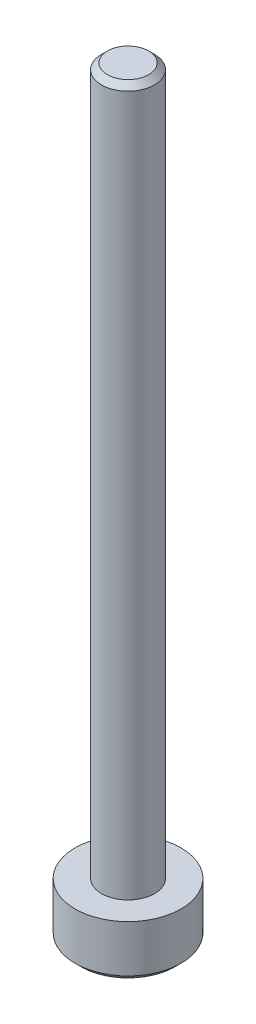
ISO-10303-21;
HEADER;
FILE_DESCRIPTION(('STEP AP214'),'2;1');
FILE_NAME('part.step','',(''),(''),'','','');
FILE_SCHEMA(('AUTOMOTIVE_DESIGN { 1 0 10303 214 1 1 1 1 }'));
ENDSEC;
DATA;
#1=APPLICATION_CONTEXT('core data for automotive mechanical design processes');
#2=APPLICATION_PROTOCOL_DEFINITION('international standard','automotive_design',2000,#1);
#3=PRODUCT_CONTEXT('',#1,'mechanical');
#4=PRODUCT('Part','Part','',(#3));
#5=PRODUCT_RELATED_PRODUCT_CATEGORY('part','',(#4));
#6=PRODUCT_DEFINITION_FORMATION('','',#4);
#7=PRODUCT_DEFINITION_CONTEXT('part definition',#1,'design');
#8=PRODUCT_DEFINITION('design','',#6,#7);
#9=PRODUCT_DEFINITION_SHAPE('','',#8);
#10=(LENGTH_UNIT() NAMED_UNIT(*) SI_UNIT(.MILLI.,.METRE.));
#11=(NAMED_UNIT(*) PLANE_ANGLE_UNIT() SI_UNIT($,.RADIAN.));
#12=(NAMED_UNIT(*) SI_UNIT($,.STERADIAN.) SOLID_ANGLE_UNIT());
#13=UNCERTAINTY_MEASURE_WITH_UNIT(LENGTH_MEASURE(1.E-05),#10,'distance_accuracy_value','');
#14=(GEOMETRIC_REPRESENTATION_CONTEXT(3) GLOBAL_UNCERTAINTY_ASSIGNED_CONTEXT((#13)) GLOBAL_UNIT_ASSIGNED_CONTEXT((#10,
#11,#12)) REPRESENTATION_CONTEXT('',''));
#15=CARTESIAN_POINT('',(0.,0.,0.));
#16=DIRECTION('',(0.,0.,1.));
#17=DIRECTION('',(1.,0.,0.));
#18=AXIS2_PLACEMENT_3D('',#15,#16,#17);
#19=CARTESIAN_POINT('',(0.,40.,0.));
#20=DIRECTION('',(0.,-1.,0.));
#21=DIRECTION('',(0.,0.,-1.));
#22=AXIS2_PLACEMENT_3D('',#19,#20,#21);
#23=CYLINDRICAL_SURFACE('',#22,1.5);
#24=CARTESIAN_POINT('',(0.,39.6666666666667,0.));
#25=DIRECTION('',(0.,1.,0.));
#26=DIRECTION('',(0.,0.,1.));
#27=AXIS2_PLACEMENT_3D('',#24,#25,#26);
#28=CIRCLE('',#27,1.5);
#29=CARTESIAN_POINT('',(0.,39.6666666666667,1.5));
#30=VERTEX_POINT('',#29);
#31=EDGE_CURVE('E182',#30,#30,#28,.F.);
#32=ORIENTED_EDGE('',*,*,#31,.T.);
#33=EDGE_LOOP('',(#32));
#34=FACE_BOUND('',#33,.T.);
#35=CARTESIAN_POINT('',(0.,0.,0.));
#36=DIRECTION('',(0.,1.,0.));
#37=DIRECTION('',(0.,0.,1.));
#38=AXIS2_PLACEMENT_3D('',#35,#36,#37);
#39=CIRCLE('',#38,1.5);
#40=CARTESIAN_POINT('',(0.,0.,1.5));
#41=VERTEX_POINT('',#40);
#42=EDGE_CURVE('E174',#41,#41,#39,.T.);
#43=ORIENTED_EDGE('',*,*,#42,.T.);
#44=EDGE_LOOP('',(#43));
#45=FACE_BOUND('',#44,.T.);
#46=ADVANCED_FACE('F45',(#34,#45),#23,.T.);
#47=CARTESIAN_POINT('',(0.,40.,0.));
#48=DIRECTION('',(0.,1.,0.));
#49=DIRECTION('',(0.,0.,1.));
#50=AXIS2_PLACEMENT_3D('',#47,#48,#49);
#51=PLANE('',#50);
#52=CARTESIAN_POINT('',(0.,40.,0.));
#53=DIRECTION('',(0.,1.,0.));
#54=DIRECTION('',(0.,0.,1.));
#55=AXIS2_PLACEMENT_3D('',#52,#53,#54);
#56=CIRCLE('',#55,1.16666666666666);
#57=CARTESIAN_POINT('',(0.,40.,1.16666666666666));
#58=VERTEX_POINT('',#57);
#59=EDGE_CURVE('E178',#58,#58,#56,.T.);
#60=ORIENTED_EDGE('',*,*,#59,.T.);
#61=EDGE_LOOP('',(#60));
#62=FACE_BOUND('',#61,.T.);
#63=ADVANCED_FACE('F201',(#62),#51,.T.);
#64=CARTESIAN_POINT('',(0.,-3.,0.));
#65=DIRECTION('',(0.,1.,0.));
#66=DIRECTION('',(0.,0.,1.));
#67=AXIS2_PLACEMENT_3D('',#64,#65,#66);
#68=CYLINDRICAL_SURFACE('',#67,3.);
#69=CARTESIAN_POINT('',(0.,-2.66666666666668,0.));
#70=DIRECTION('',(0.,-1.,0.));
#71=DIRECTION('',(0.,0.,-1.));
#72=AXIS2_PLACEMENT_3D('',#69,#70,#71);
#73=CIRCLE('',#72,3.);
#74=CARTESIAN_POINT('',(0.,-2.66666666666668,-3.));
#75=VERTEX_POINT('',#74);
#76=EDGE_CURVE('E11',#75,#75,#73,.F.);
#77=ORIENTED_EDGE('',*,*,#76,.T.);
#78=EDGE_LOOP('',(#77));
#79=FACE_BOUND('',#78,.T.);
#80=CARTESIAN_POINT('',(0.,0.,0.));
#81=DIRECTION('',(0.,-1.,0.));
#82=DIRECTION('',(0.,0.,-1.));
#83=AXIS2_PLACEMENT_3D('',#80,#81,#82);
#84=CIRCLE('',#83,3.);
#85=CARTESIAN_POINT('',(0.,0.,-3.));
#86=VERTEX_POINT('',#85);
#87=EDGE_CURVE('E161',#86,#86,#84,.T.);
#88=ORIENTED_EDGE('',*,*,#87,.T.);
#89=EDGE_LOOP('',(#88));
#90=FACE_BOUND('',#89,.T.);
#91=ADVANCED_FACE('F207',(#79,#90),#68,.T.);
#92=CARTESIAN_POINT('',(0.,-3.,0.));
#93=DIRECTION('',(0.,-1.,0.));
#94=DIRECTION('',(0.,0.,-1.));
#95=AXIS2_PLACEMENT_3D('',#92,#93,#94);
#96=PLANE('',#95);
#97=CARTESIAN_POINT('',(0.,-3.,0.));
#98=DIRECTION('',(0.,-1.,0.));
#99=DIRECTION('',(0.,0.,-1.));
#100=AXIS2_PLACEMENT_3D('',#97,#98,#99);
#101=CIRCLE('',#100,2.66666666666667);
#102=CARTESIAN_POINT('',(0.,-3.,-2.66666666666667));
#103=VERTEX_POINT('',#102);
#104=EDGE_CURVE('E55',#103,#103,#101,.T.);
#105=ORIENTED_EDGE('',*,*,#104,.T.);
#106=EDGE_LOOP('',(#105));
#107=FACE_BOUND('',#106,.T.);
#108=DIRECTION('',(-0.866025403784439,0.,0.5));
#109=VECTOR('',#108,1.);
#110=CARTESIAN_POINT('',(1.5,-3.,0.86602540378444));
#111=LINE('',#110,#109);
#112=CARTESIAN_POINT('',(1.5,-3.,0.86602540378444));
#113=VERTEX_POINT('',#112);
#114=CARTESIAN_POINT('',(0.,-3.,1.73205080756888));
#115=VERTEX_POINT('',#114);
#116=EDGE_CURVE('E62',#113,#115,#111,.T.);
#117=ORIENTED_EDGE('',*,*,#116,.F.);
#118=DIRECTION('',(0.,0.,1.));
#119=VECTOR('',#118,1.);
#120=CARTESIAN_POINT('',(1.5,-3.,-0.866025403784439));
#121=LINE('',#120,#119);
#122=CARTESIAN_POINT('',(1.5,-3.,-0.866025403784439));
#123=VERTEX_POINT('',#122);
#124=EDGE_CURVE('E155',#123,#113,#121,.T.);
#125=ORIENTED_EDGE('',*,*,#124,.F.);
#126=DIRECTION('',(0.866025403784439,0.,0.5));
#127=VECTOR('',#126,1.);
#128=CARTESIAN_POINT('',(0.,-3.,-1.73205080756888));
#129=LINE('',#128,#127);
#130=CARTESIAN_POINT('',(0.,-3.,-1.73205080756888));
#131=VERTEX_POINT('',#130);
#132=EDGE_CURVE('E152',#131,#123,#129,.T.);
#133=ORIENTED_EDGE('',*,*,#132,.F.);
#134=DIRECTION('',(0.866025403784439,0.,-0.5));
#135=VECTOR('',#134,1.);
#136=CARTESIAN_POINT('',(-1.5,-3.,-0.866025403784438));
#137=LINE('',#136,#135);
#138=CARTESIAN_POINT('',(-1.5,-3.,-0.866025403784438));
#139=VERTEX_POINT('',#138);
#140=EDGE_CURVE('E110',#139,#131,#137,.T.);
#141=ORIENTED_EDGE('',*,*,#140,.F.);
#142=DIRECTION('',(0.,0.,-1.));
#143=VECTOR('',#142,1.);
#144=CARTESIAN_POINT('',(-1.5,-3.,0.86602540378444));
#145=LINE('',#144,#143);
#146=CARTESIAN_POINT('',(-1.5,-3.,0.86602540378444));
#147=VERTEX_POINT('',#146);
#148=EDGE_CURVE('E146',#147,#139,#145,.T.);
#149=ORIENTED_EDGE('',*,*,#148,.F.);
#150=DIRECTION('',(-0.866025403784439,0.,-0.5));
#151=VECTOR('',#150,1.);
#152=CARTESIAN_POINT('',(0.,-3.,1.73205080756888));
#153=LINE('',#152,#151);
#154=EDGE_CURVE('E142',#115,#147,#153,.T.);
#155=ORIENTED_EDGE('',*,*,#154,.F.);
#156=EDGE_LOOP('',(#117,#125,#133,#141,#149,#155));
#157=FACE_BOUND('',#156,.T.);
#158=ADVANCED_FACE('F189',(#107,#157),#96,.T.);
#159=CARTESIAN_POINT('',(0.,0.,0.));
#160=DIRECTION('',(0.,-1.,0.));
#161=DIRECTION('',(0.,0.,-1.));
#162=AXIS2_PLACEMENT_3D('',#159,#160,#161);
#163=PLANE('',#162);
#164=ORIENTED_EDGE('',*,*,#42,.F.);
#165=EDGE_LOOP('',(#164));
#166=FACE_BOUND('',#165,.T.);
#167=ORIENTED_EDGE('',*,*,#87,.F.);
#168=EDGE_LOOP('',(#167));
#169=FACE_BOUND('',#168,.T.);
#170=ADVANCED_FACE('F220',(#166,#169),#163,.F.);
#171=CARTESIAN_POINT('',(1.5,-1.,0.86602540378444));
#172=DIRECTION('',(0.5,0.,0.866025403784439));
#173=DIRECTION('',(0.866025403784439,0.,-0.5));
#174=AXIS2_PLACEMENT_3D('',#171,#172,#173);
#175=PLANE('',#174);
#176=ORIENTED_EDGE('',*,*,#116,.T.);
#177=DIRECTION('',(0.,-1.,0.));
#178=VECTOR('',#177,1.);
#179=CARTESIAN_POINT('',(0.,-1.,1.73205080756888));
#180=LINE('',#179,#178);
#181=CARTESIAN_POINT('',(0.,-1.,1.73205080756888));
#182=VERTEX_POINT('',#181);
#183=EDGE_CURVE('E92',#182,#115,#180,.T.);
#184=ORIENTED_EDGE('',*,*,#183,.F.);
#185=DIRECTION('',(-0.866025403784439,0.,0.5));
#186=VECTOR('',#185,1.);
#187=CARTESIAN_POINT('',(1.5,-1.,0.86602540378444));
#188=LINE('',#187,#186);
#189=CARTESIAN_POINT('',(1.5,-1.,0.86602540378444));
#190=VERTEX_POINT('',#189);
#191=EDGE_CURVE('E158',#190,#182,#188,.T.);
#192=ORIENTED_EDGE('',*,*,#191,.F.);
#193=DIRECTION('',(0.,-1.,0.));
#194=VECTOR('',#193,1.);
#195=CARTESIAN_POINT('',(1.5,-1.,0.86602540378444));
#196=LINE('',#195,#194);
#197=EDGE_CURVE('E70',#190,#113,#196,.T.);
#198=ORIENTED_EDGE('',*,*,#197,.T.);
#199=EDGE_LOOP('',(#176,#184,#192,#198));
#200=FACE_BOUND('',#199,.T.);
#201=ADVANCED_FACE('F223',(#200),#175,.F.);
#202=CARTESIAN_POINT('',(1.5,-1.,-0.866025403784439));
#203=DIRECTION('',(1.,0.,0.));
#204=DIRECTION('',(0.,0.,-1.));
#205=AXIS2_PLACEMENT_3D('',#202,#203,#204);
#206=PLANE('',#205);
#207=ORIENTED_EDGE('',*,*,#124,.T.);
#208=ORIENTED_EDGE('',*,*,#197,.F.);
#209=DIRECTION('',(0.,0.,1.));
#210=VECTOR('',#209,1.);
#211=CARTESIAN_POINT('',(1.5,-1.,-0.866025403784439));
#212=LINE('',#211,#210);
#213=CARTESIAN_POINT('',(1.5,-1.,-0.866025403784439));
#214=VERTEX_POINT('',#213);
#215=EDGE_CURVE('E124',#214,#190,#212,.T.);
#216=ORIENTED_EDGE('',*,*,#215,.F.);
#217=DIRECTION('',(0.,-1.,0.));
#218=VECTOR('',#217,1.);
#219=CARTESIAN_POINT('',(1.5,-1.,-0.866025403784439));
#220=LINE('',#219,#218);
#221=EDGE_CURVE('E115',#214,#123,#220,.T.);
#222=ORIENTED_EDGE('',*,*,#221,.T.);
#223=EDGE_LOOP('',(#207,#208,#216,#222));
#224=FACE_BOUND('',#223,.T.);
#225=ADVANCED_FACE('F229',(#224),#206,.F.);
#226=CARTESIAN_POINT('',(0.,-1.,-1.73205080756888));
#227=DIRECTION('',(0.5,0.,-0.866025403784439));
#228=DIRECTION('',(-0.866025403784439,0.,-0.5));
#229=AXIS2_PLACEMENT_3D('',#226,#227,#228);
#230=PLANE('',#229);
#231=ORIENTED_EDGE('',*,*,#132,.T.);
#232=ORIENTED_EDGE('',*,*,#221,.F.);
#233=DIRECTION('',(0.866025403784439,0.,0.5));
#234=VECTOR('',#233,1.);
#235=CARTESIAN_POINT('',(0.,-1.,-1.73205080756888));
#236=LINE('',#235,#234);
#237=CARTESIAN_POINT('',(0.,-1.,-1.73205080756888));
#238=VERTEX_POINT('',#237);
#239=EDGE_CURVE('E119',#238,#214,#236,.T.);
#240=ORIENTED_EDGE('',*,*,#239,.F.);
#241=DIRECTION('',(0.,-1.,0.));
#242=VECTOR('',#241,1.);
#243=CARTESIAN_POINT('',(0.,-1.,-1.73205080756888));
#244=LINE('',#243,#242);
#245=EDGE_CURVE('E103',#238,#131,#244,.T.);
#246=ORIENTED_EDGE('',*,*,#245,.T.);
#247=EDGE_LOOP('',(#231,#232,#240,#246));
#248=FACE_BOUND('',#247,.T.);
#249=ADVANCED_FACE('F120',(#248),#230,.F.);
#250=CARTESIAN_POINT('',(-1.5,-1.,-0.866025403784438));
#251=DIRECTION('',(-0.5,0.,-0.866025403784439));
#252=DIRECTION('',(-0.866025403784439,0.,0.5));
#253=AXIS2_PLACEMENT_3D('',#250,#251,#252);
#254=PLANE('',#253);
#255=ORIENTED_EDGE('',*,*,#140,.T.);
#256=ORIENTED_EDGE('',*,*,#245,.F.);
#257=DIRECTION('',(0.866025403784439,0.,-0.5));
#258=VECTOR('',#257,1.);
#259=CARTESIAN_POINT('',(-1.5,-1.,-0.866025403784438));
#260=LINE('',#259,#258);
#261=CARTESIAN_POINT('',(-1.5,-1.,-0.866025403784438));
#262=VERTEX_POINT('',#261);
#263=EDGE_CURVE('E107',#262,#238,#260,.T.);
#264=ORIENTED_EDGE('',*,*,#263,.F.);
#265=DIRECTION('',(0.,-1.,0.));
#266=VECTOR('',#265,1.);
#267=CARTESIAN_POINT('',(-1.5,-1.,-0.866025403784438));
#268=LINE('',#267,#266);
#269=EDGE_CURVE('E116',#262,#139,#268,.T.);
#270=ORIENTED_EDGE('',*,*,#269,.T.);
#271=EDGE_LOOP('',(#255,#256,#264,#270));
#272=FACE_BOUND('',#271,.T.);
#273=ADVANCED_FACE('F105',(#272),#254,.F.);
#274=CARTESIAN_POINT('',(-1.5,-1.,0.86602540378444));
#275=DIRECTION('',(-1.,0.,0.));
#276=DIRECTION('',(0.,0.,1.));
#277=AXIS2_PLACEMENT_3D('',#274,#275,#276);
#278=PLANE('',#277);
#279=ORIENTED_EDGE('',*,*,#148,.T.);
#280=ORIENTED_EDGE('',*,*,#269,.F.);
#281=DIRECTION('',(0.,0.,-1.));
#282=VECTOR('',#281,1.);
#283=CARTESIAN_POINT('',(-1.5,-1.,0.86602540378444));
#284=LINE('',#283,#282);
#285=CARTESIAN_POINT('',(-1.5,-1.,0.86602540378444));
#286=VERTEX_POINT('',#285);
#287=EDGE_CURVE('E130',#286,#262,#284,.T.);
#288=ORIENTED_EDGE('',*,*,#287,.F.);
#289=DIRECTION('',(0.,-1.,0.));
#290=VECTOR('',#289,1.);
#291=CARTESIAN_POINT('',(-1.5,-1.,0.86602540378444));
#292=LINE('',#291,#290);
#293=EDGE_CURVE('E166',#286,#147,#292,.T.);
#294=ORIENTED_EDGE('',*,*,#293,.T.);
#295=EDGE_LOOP('',(#279,#280,#288,#294));
#296=FACE_BOUND('',#295,.T.);
#297=ADVANCED_FACE('F233',(#296),#278,.F.);
#298=CARTESIAN_POINT('',(0.,-1.,1.73205080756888));
#299=DIRECTION('',(-0.5,0.,0.866025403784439));
#300=DIRECTION('',(0.866025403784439,0.,0.5));
#301=AXIS2_PLACEMENT_3D('',#298,#299,#300);
#302=PLANE('',#301);
#303=ORIENTED_EDGE('',*,*,#154,.T.);
#304=ORIENTED_EDGE('',*,*,#293,.F.);
#305=DIRECTION('',(-0.866025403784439,0.,-0.5));
#306=VECTOR('',#305,1.);
#307=CARTESIAN_POINT('',(0.,-1.,1.73205080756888));
#308=LINE('',#307,#306);
#309=EDGE_CURVE('E134',#182,#286,#308,.T.);
#310=ORIENTED_EDGE('',*,*,#309,.F.);
#311=ORIENTED_EDGE('',*,*,#183,.T.);
#312=EDGE_LOOP('',(#303,#304,#310,#311));
#313=FACE_BOUND('',#312,.T.);
#314=ADVANCED_FACE('F230',(#313),#302,.F.);
#315=CARTESIAN_POINT('',(0.,-1.,0.));
#316=DIRECTION('',(0.,-1.,0.));
#317=DIRECTION('',(0.,0.,-1.));
#318=AXIS2_PLACEMENT_3D('',#315,#316,#317);
#319=PLANE('',#318);
#320=ORIENTED_EDGE('',*,*,#191,.T.);
#321=ORIENTED_EDGE('',*,*,#309,.T.);
#322=ORIENTED_EDGE('',*,*,#287,.T.);
#323=ORIENTED_EDGE('',*,*,#263,.T.);
#324=ORIENTED_EDGE('',*,*,#239,.T.);
#325=ORIENTED_EDGE('',*,*,#215,.T.);
#326=EDGE_LOOP('',(#320,#321,#322,#323,#324,#325));
#327=FACE_BOUND('',#326,.T.);
#328=ADVANCED_FACE('F127',(#327),#319,.T.);
#329=CARTESIAN_POINT('',(0.,40.,0.));
#330=DIRECTION('',(0.,-1.,0.));
#331=DIRECTION('',(0.,0.,-1.));
#332=AXIS2_PLACEMENT_3D('',#329,#330,#331);
#333=CONICAL_SURFACE('',#332,1.16666666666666,0.785398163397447);
#334=ORIENTED_EDGE('',*,*,#31,.F.);
#335=EDGE_LOOP('',(#334));
#336=FACE_BOUND('',#335,.T.);
#337=ORIENTED_EDGE('',*,*,#59,.F.);
#338=EDGE_LOOP('',(#337));
#339=FACE_BOUND('',#338,.T.);
#340=ADVANCED_FACE('F193',(#336,#339),#333,.T.);
#341=CARTESIAN_POINT('',(0.,-3.,0.));
#342=DIRECTION('',(0.,1.,0.));
#343=DIRECTION('',(0.,0.,1.));
#344=AXIS2_PLACEMENT_3D('',#341,#342,#343);
#345=CONICAL_SURFACE('',#344,2.66666666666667,0.785398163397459);
#346=ORIENTED_EDGE('',*,*,#76,.F.);
#347=EDGE_LOOP('',(#346));
#348=FACE_BOUND('',#347,.T.);
#349=ORIENTED_EDGE('',*,*,#104,.F.);
#350=EDGE_LOOP('',(#349));
#351=FACE_BOUND('',#350,.T.);
#352=ADVANCED_FACE('F48',(#348,#351),#345,.T.);
#353=CLOSED_SHELL('',(#46,#63,#91,#158,#170,#201,#225,#249,#273,#297,#314,#328,#340,#352));
#354=MANIFOLD_SOLID_BREP('B2',#353);
#355=ADVANCED_BREP_SHAPE_REPRESENTATION('',(#18,#354),#14);
#356=SHAPE_DEFINITION_REPRESENTATION(#9,#355);
ENDSEC;
END-ISO-10303-21;
